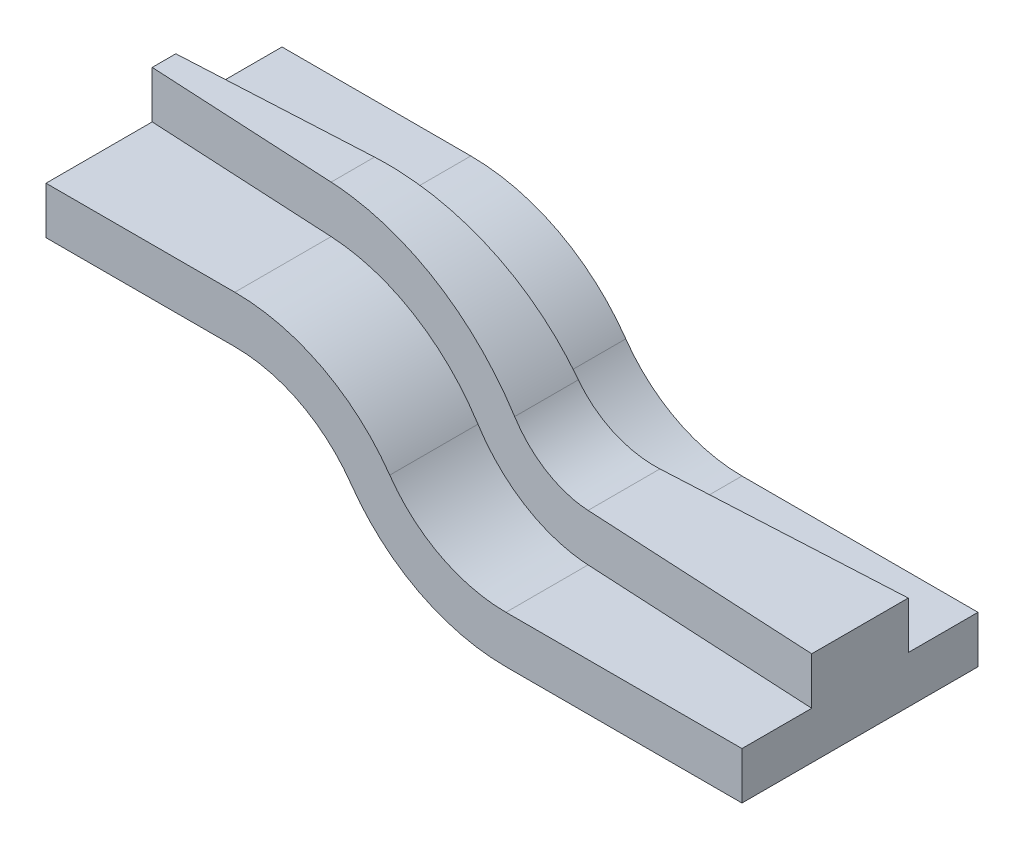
ISO-10303-21;
HEADER;
FILE_DESCRIPTION(('STEP AP214'),'2;1');
FILE_NAME('part.step','',(''),(''),'','','');
FILE_SCHEMA(('AUTOMOTIVE_DESIGN { 1 0 10303 214 1 1 1 1 }'));
ENDSEC;
DATA;
#1=APPLICATION_CONTEXT('core data for automotive mechanical design processes');
#2=APPLICATION_PROTOCOL_DEFINITION('international standard','automotive_design',2000,#1);
#3=PRODUCT_CONTEXT('',#1,'mechanical');
#4=PRODUCT('Part','Part','',(#3));
#5=PRODUCT_RELATED_PRODUCT_CATEGORY('part','',(#4));
#6=PRODUCT_DEFINITION_FORMATION('','',#4);
#7=PRODUCT_DEFINITION_CONTEXT('part definition',#1,'design');
#8=PRODUCT_DEFINITION('design','',#6,#7);
#9=PRODUCT_DEFINITION_SHAPE('','',#8);
#10=(LENGTH_UNIT() NAMED_UNIT(*) SI_UNIT(.MILLI.,.METRE.));
#11=(NAMED_UNIT(*) PLANE_ANGLE_UNIT() SI_UNIT($,.RADIAN.));
#12=(NAMED_UNIT(*) SI_UNIT($,.STERADIAN.) SOLID_ANGLE_UNIT());
#13=UNCERTAINTY_MEASURE_WITH_UNIT(LENGTH_MEASURE(1.E-05),#10,'distance_accuracy_value','');
#14=(GEOMETRIC_REPRESENTATION_CONTEXT(3) GLOBAL_UNCERTAINTY_ASSIGNED_CONTEXT((#13)) GLOBAL_UNIT_ASSIGNED_CONTEXT((#10,
#11,#12)) REPRESENTATION_CONTEXT('',''));
#15=CARTESIAN_POINT('',(0.,0.,0.));
#16=DIRECTION('',(0.,0.,1.));
#17=DIRECTION('',(1.,0.,0.));
#18=AXIS2_PLACEMENT_3D('',#15,#16,#17);
#19=CARTESIAN_POINT('',(97.4456264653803,-30.,25.));
#20=DIRECTION('',(0.,1.,0.));
#21=DIRECTION('',(-1.,0.,0.));
#22=AXIS2_PLACEMENT_3D('',#19,#20,#21);
#23=PLANE('',#22);
#24=DIRECTION('',(0.,0.,-1.));
#25=VECTOR('',#24,1.);
#26=CARTESIAN_POINT('',(97.4456264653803,-30.,25.));
#27=LINE('',#26,#25);
#28=CARTESIAN_POINT('',(97.4456264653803,-30.,-7.60690888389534));
#29=VERTEX_POINT('',#28);
#30=CARTESIAN_POINT('',(97.4456264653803,-30.,-25.));
#31=VERTEX_POINT('',#30);
#32=EDGE_CURVE('E309',#29,#31,#27,.T.);
#33=ORIENTED_EDGE('',*,*,#32,.F.);
#34=DIRECTION('',(0.998629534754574,0.,-0.052335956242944));
#35=VECTOR('',#34,1.);
#36=CARTESIAN_POINT('',(95.7414514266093,-30.,-7.51759685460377));
#37=LINE('',#36,#35);
#38=CARTESIAN_POINT('',(147.44562646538,-30.,-10.2272978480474));
#39=VERTEX_POINT('',#38);
#40=EDGE_CURVE('E226',#29,#39,#37,.T.);
#41=ORIENTED_EDGE('',*,*,#40,.T.);
#42=DIRECTION('',(0.,0.,-1.));
#43=VECTOR('',#42,1.);
#44=CARTESIAN_POINT('',(147.44562646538,-30.,25.));
#45=LINE('',#44,#43);
#46=CARTESIAN_POINT('',(147.44562646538,-30.,-25.));
#47=VERTEX_POINT('',#46);
#48=EDGE_CURVE('E312',#39,#47,#45,.T.);
#49=ORIENTED_EDGE('',*,*,#48,.T.);
#50=DIRECTION('',(1.,0.,0.));
#51=VECTOR('',#50,1.);
#52=CARTESIAN_POINT('',(97.4456264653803,-30.,-25.));
#53=LINE('',#52,#51);
#54=EDGE_CURVE('E243',#31,#47,#53,.T.);
#55=ORIENTED_EDGE('',*,*,#54,.F.);
#56=EDGE_LOOP('',(#33,#41,#49,#55));
#57=FACE_BOUND('',#56,.T.);
#58=ADVANCED_FACE('F33',(#57),#23,.T.);
#59=CARTESIAN_POINT('',(97.4456264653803,0.,25.));
#60=DIRECTION('',(0.,0.,-1.));
#61=DIRECTION('',(-1.,0.,0.));
#62=AXIS2_PLACEMENT_3D('',#59,#60,#61);
#63=CYLINDRICAL_SURFACE('',#62,30.);
#64=DIRECTION('',(0.,0.,-1.));
#65=VECTOR('',#64,1.);
#66=CARTESIAN_POINT('',(72.8260722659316,-17.1428571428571,25.));
#67=LINE('',#66,#65);
#68=CARTESIAN_POINT('',(72.8260722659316,-17.1428571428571,-6.31665272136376));
#69=VERTEX_POINT('',#68);
#70=CARTESIAN_POINT('',(72.8260722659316,-17.1428571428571,-25.));
#71=VERTEX_POINT('',#70);
#72=EDGE_CURVE('E305',#69,#71,#67,.T.);
#73=ORIENTED_EDGE('',*,*,#72,.F.);
#74=CARTESIAN_POINT('',(97.4456264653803,0.,-7.60690888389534));
#75=DIRECTION('',(0.0523359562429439,0.,0.998629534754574));
#76=DIRECTION('',(0.998629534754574,0.,-0.052335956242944));
#77=AXIS2_PLACEMENT_3D('',#74,#75,#76);
#78=ELLIPSE('',#77,30.0411703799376,30.);
#79=EDGE_CURVE('E223',#69,#29,#78,.T.);
#80=ORIENTED_EDGE('',*,*,#79,.T.);
#81=ORIENTED_EDGE('',*,*,#32,.T.);
#82=CARTESIAN_POINT('',(97.4456264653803,0.,-25.));
#83=DIRECTION('',(0.,0.,1.));
#84=DIRECTION('',(1.,0.,0.));
#85=AXIS2_PLACEMENT_3D('',#82,#83,#84);
#86=CIRCLE('',#85,30.);
#87=EDGE_CURVE('E246',#71,#31,#86,.T.);
#88=ORIENTED_EDGE('',*,*,#87,.F.);
#89=EDGE_LOOP('',(#73,#80,#81,#88));
#90=FACE_BOUND('',#89,.T.);
#91=ADVANCED_FACE('F331',(#90),#63,.F.);
#92=CARTESIAN_POINT('',(40.,-40.,25.));
#93=DIRECTION('',(0.,0.,-1.));
#94=DIRECTION('',(-1.,0.,0.));
#95=AXIS2_PLACEMENT_3D('',#92,#93,#94);
#96=CYLINDRICAL_SURFACE('',#95,40.);
#97=DIRECTION('',(0.,0.,-1.));
#98=VECTOR('',#97,1.);
#99=CARTESIAN_POINT('',(40.,0.,25.));
#100=LINE('',#99,#98);
#101=CARTESIAN_POINT('',(40.,0.,-4.59631117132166));
#102=VERTEX_POINT('',#101);
#103=CARTESIAN_POINT('',(40.,0.,-25.));
#104=VERTEX_POINT('',#103);
#105=EDGE_CURVE('E301',#102,#104,#100,.T.);
#106=ORIENTED_EDGE('',*,*,#105,.F.);
#107=CARTESIAN_POINT('',(40.,-40.,-4.59631117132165));
#108=DIRECTION('',(0.0523359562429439,0.,0.998629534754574));
#109=DIRECTION('',(0.998629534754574,0.,-0.052335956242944));
#110=AXIS2_PLACEMENT_3D('',#107,#108,#109);
#111=ELLIPSE('',#110,40.0548938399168,40.);
#112=EDGE_CURVE('E220',#102,#69,#111,.F.);
#113=ORIENTED_EDGE('',*,*,#112,.T.);
#114=ORIENTED_EDGE('',*,*,#72,.T.);
#115=CARTESIAN_POINT('',(40.,-40.,-25.));
#116=DIRECTION('',(0.,0.,-1.));
#117=DIRECTION('',(-1.,0.,0.));
#118=AXIS2_PLACEMENT_3D('',#115,#116,#117);
#119=CIRCLE('',#118,40.);
#120=EDGE_CURVE('E249',#104,#71,#119,.T.);
#121=ORIENTED_EDGE('',*,*,#120,.F.);
#122=EDGE_LOOP('',(#106,#113,#114,#121));
#123=FACE_BOUND('',#122,.T.);
#124=ADVANCED_FACE('F336',(#123),#96,.T.);
#125=CARTESIAN_POINT('',(0.,0.,25.));
#126=DIRECTION('',(0.,1.,0.));
#127=DIRECTION('',(0.,0.,1.));
#128=AXIS2_PLACEMENT_3D('',#125,#126,#127);
#129=PLANE('',#128);
#130=DIRECTION('',(0.,0.,-1.));
#131=VECTOR('',#130,1.);
#132=CARTESIAN_POINT('',(0.,0.,25.));
#133=LINE('',#132,#131);
#134=CARTESIAN_POINT('',(0.,0.,-2.5));
#135=VERTEX_POINT('',#134);
#136=CARTESIAN_POINT('',(0.,0.,-25.));
#137=VERTEX_POINT('',#136);
#138=EDGE_CURVE('E299',#135,#137,#133,.T.);
#139=ORIENTED_EDGE('',*,*,#138,.F.);
#140=DIRECTION('',(0.998629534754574,0.,-0.052335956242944));
#141=VECTOR('',#140,1.);
#142=CARTESIAN_POINT('',(-1.43726636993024,0.,-2.42467606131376));
#143=LINE('',#142,#141);
#144=EDGE_CURVE('E217',#135,#102,#143,.T.);
#145=ORIENTED_EDGE('',*,*,#144,.T.);
#146=ORIENTED_EDGE('',*,*,#105,.T.);
#147=DIRECTION('',(1.,0.,0.));
#148=VECTOR('',#147,1.);
#149=CARTESIAN_POINT('',(0.,0.,-25.));
#150=LINE('',#149,#148);
#151=EDGE_CURVE('E252',#137,#104,#150,.T.);
#152=ORIENTED_EDGE('',*,*,#151,.F.);
#153=EDGE_LOOP('',(#139,#145,#146,#152));
#154=FACE_BOUND('',#153,.T.);
#155=ADVANCED_FACE('F340',(#154),#129,.T.);
#156=CARTESIAN_POINT('',(97.4456264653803,-40.,25.));
#157=DIRECTION('',(0.,1.,0.));
#158=DIRECTION('',(-1.,0.,0.));
#159=AXIS2_PLACEMENT_3D('',#156,#157,#158);
#160=PLANE('',#159);
#161=DIRECTION('',(0.,0.,-1.));
#162=VECTOR('',#161,1.);
#163=CARTESIAN_POINT('',(97.4456264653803,-40.,25.));
#164=LINE('',#163,#162);
#165=CARTESIAN_POINT('',(97.4456264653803,-40.,25.));
#166=VERTEX_POINT('',#165);
#167=CARTESIAN_POINT('',(97.4456264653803,-40.,-25.));
#168=VERTEX_POINT('',#167);
#169=EDGE_CURVE('E291',#166,#168,#164,.T.);
#170=ORIENTED_EDGE('',*,*,#169,.T.);
#171=DIRECTION('',(1.,0.,0.));
#172=VECTOR('',#171,1.);
#173=CARTESIAN_POINT('',(97.4456264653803,-40.,-25.));
#174=LINE('',#173,#172);
#175=CARTESIAN_POINT('',(147.44562646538,-40.,-25.));
#176=VERTEX_POINT('',#175);
#177=EDGE_CURVE('E237',#168,#176,#174,.T.);
#178=ORIENTED_EDGE('',*,*,#177,.T.);
#179=DIRECTION('',(0.,0.,-1.));
#180=VECTOR('',#179,1.);
#181=CARTESIAN_POINT('',(147.44562646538,-40.,25.));
#182=LINE('',#181,#180);
#183=CARTESIAN_POINT('',(147.44562646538,-40.,25.));
#184=VERTEX_POINT('',#183);
#185=EDGE_CURVE('E11',#184,#176,#182,.T.);
#186=ORIENTED_EDGE('',*,*,#185,.F.);
#187=DIRECTION('',(1.,0.,0.));
#188=VECTOR('',#187,1.);
#189=CARTESIAN_POINT('',(97.4456264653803,-40.,25.));
#190=LINE('',#189,#188);
#191=EDGE_CURVE('E267',#166,#184,#190,.T.);
#192=ORIENTED_EDGE('',*,*,#191,.F.);
#193=EDGE_LOOP('',(#170,#178,#186,#192));
#194=FACE_BOUND('',#193,.T.);
#195=ADVANCED_FACE('F35',(#194),#160,.F.);
#196=CARTESIAN_POINT('',(147.44562646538,-30.,25.));
#197=DIRECTION('',(1.,0.,0.));
#198=DIRECTION('',(0.,0.,-1.));
#199=AXIS2_PLACEMENT_3D('',#196,#197,#198);
#200=PLANE('',#199);
#201=ORIENTED_EDGE('',*,*,#185,.T.);
#202=DIRECTION('',(0.,-1.,0.));
#203=VECTOR('',#202,1.);
#204=CARTESIAN_POINT('',(147.44562646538,-30.,-25.));
#205=LINE('',#204,#203);
#206=EDGE_CURVE('E240',#47,#176,#205,.T.);
#207=ORIENTED_EDGE('',*,*,#206,.F.);
#208=ORIENTED_EDGE('',*,*,#48,.F.);
#209=DIRECTION('',(0.,-1.,0.));
#210=VECTOR('',#209,1.);
#211=CARTESIAN_POINT('',(147.44562646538,-20.,-10.2272978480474));
#212=LINE('',#211,#210);
#213=CARTESIAN_POINT('',(147.44562646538,-20.,-10.2272978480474));
#214=VERTEX_POINT('',#213);
#215=EDGE_CURVE('E192',#39,#214,#212,.F.);
#216=ORIENTED_EDGE('',*,*,#215,.T.);
#217=DIRECTION('',(0.,0.,1.));
#218=VECTOR('',#217,1.);
#219=CARTESIAN_POINT('',(147.44562646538,-20.,0.));
#220=LINE('',#219,#218);
#221=CARTESIAN_POINT('',(147.44562646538,-20.,10.2272978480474));
#222=VERTEX_POINT('',#221);
#223=EDGE_CURVE('E197',#214,#222,#220,.T.);
#224=ORIENTED_EDGE('',*,*,#223,.T.);
#225=DIRECTION('',(0.,1.,0.));
#226=VECTOR('',#225,1.);
#227=CARTESIAN_POINT('',(147.44562646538,-15.,10.2272978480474));
#228=LINE('',#227,#226);
#229=CARTESIAN_POINT('',(147.44562646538,-30.,10.2272978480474));
#230=VERTEX_POINT('',#229);
#231=EDGE_CURVE('E177',#230,#222,#228,.T.);
#232=ORIENTED_EDGE('',*,*,#231,.F.);
#233=CARTESIAN_POINT('',(147.44562646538,-30.,25.));
#234=VERTEX_POINT('',#233);
#235=EDGE_CURVE('E41',#234,#230,#45,.T.);
#236=ORIENTED_EDGE('',*,*,#235,.F.);
#237=DIRECTION('',(0.,-1.,0.));
#238=VECTOR('',#237,1.);
#239=CARTESIAN_POINT('',(147.44562646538,-30.,25.));
#240=LINE('',#239,#238);
#241=EDGE_CURVE('E269',#234,#184,#240,.T.);
#242=ORIENTED_EDGE('',*,*,#241,.T.);
#243=EDGE_LOOP('',(#201,#207,#208,#216,#224,#232,#236,#242));
#244=FACE_BOUND('',#243,.T.);
#245=ADVANCED_FACE('F322',(#244),#200,.T.);
#246=DIRECTION('',(0.998629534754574,0.,0.052335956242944));
#247=VECTOR('',#246,1.);
#248=CARTESIAN_POINT('',(98.3546630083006,-30.,7.65454947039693));
#249=LINE('',#248,#247);
#250=CARTESIAN_POINT('',(97.4456264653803,-30.,7.60690888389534));
#251=VERTEX_POINT('',#250);
#252=EDGE_CURVE('E235',#251,#230,#249,.T.);
#253=ORIENTED_EDGE('',*,*,#252,.F.);
#254=CARTESIAN_POINT('',(97.4456264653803,-30.,25.));
#255=VERTEX_POINT('',#254);
#256=EDGE_CURVE('E310',#255,#251,#27,.T.);
#257=ORIENTED_EDGE('',*,*,#256,.F.);
#258=DIRECTION('',(1.,0.,0.));
#259=VECTOR('',#258,1.);
#260=CARTESIAN_POINT('',(97.4456264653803,-30.,25.));
#261=LINE('',#260,#259);
#262=EDGE_CURVE('E272',#255,#234,#261,.T.);
#263=ORIENTED_EDGE('',*,*,#262,.T.);
#264=ORIENTED_EDGE('',*,*,#235,.T.);
#265=EDGE_LOOP('',(#253,#257,#263,#264));
#266=FACE_BOUND('',#265,.T.);
#267=ADVANCED_FACE('F369',(#266),#23,.T.);
#268=CARTESIAN_POINT('',(97.4456264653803,0.,7.60690888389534));
#269=DIRECTION('',(-0.0523359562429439,0.,0.998629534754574));
#270=DIRECTION('',(-0.998629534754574,0.,-0.052335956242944));
#271=AXIS2_PLACEMENT_3D('',#268,#269,#270);
#272=ELLIPSE('',#271,30.0411703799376,30.);
#273=CARTESIAN_POINT('',(72.8260722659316,-17.1428571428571,6.31665272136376));
#274=VERTEX_POINT('',#273);
#275=EDGE_CURVE('E233',#274,#251,#272,.T.);
#276=ORIENTED_EDGE('',*,*,#275,.F.);
#277=CARTESIAN_POINT('',(72.8260722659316,-17.1428571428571,25.));
#278=VERTEX_POINT('',#277);
#279=EDGE_CURVE('E306',#278,#274,#67,.T.);
#280=ORIENTED_EDGE('',*,*,#279,.F.);
#281=CARTESIAN_POINT('',(97.4456264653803,0.,25.));
#282=DIRECTION('',(0.,0.,1.));
#283=DIRECTION('',(1.,0.,0.));
#284=AXIS2_PLACEMENT_3D('',#281,#282,#283);
#285=CIRCLE('',#284,30.);
#286=EDGE_CURVE('E275',#278,#255,#285,.T.);
#287=ORIENTED_EDGE('',*,*,#286,.T.);
#288=ORIENTED_EDGE('',*,*,#256,.T.);
#289=EDGE_LOOP('',(#276,#280,#287,#288));
#290=FACE_BOUND('',#289,.T.);
#291=ADVANCED_FACE('F374',(#290),#63,.F.);
#292=CARTESIAN_POINT('',(40.,-40.,4.59631117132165));
#293=DIRECTION('',(-0.0523359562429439,0.,0.998629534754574));
#294=DIRECTION('',(-0.998629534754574,0.,-0.052335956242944));
#295=AXIS2_PLACEMENT_3D('',#292,#293,#294);
#296=ELLIPSE('',#295,40.0548938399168,40.);
#297=CARTESIAN_POINT('',(40.,0.,4.59631117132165));
#298=VERTEX_POINT('',#297);
#299=EDGE_CURVE('E231',#298,#274,#296,.F.);
#300=ORIENTED_EDGE('',*,*,#299,.F.);
#301=CARTESIAN_POINT('',(40.,0.,25.));
#302=VERTEX_POINT('',#301);
#303=EDGE_CURVE('E302',#302,#298,#100,.T.);
#304=ORIENTED_EDGE('',*,*,#303,.F.);
#305=CARTESIAN_POINT('',(40.,-40.,25.));
#306=DIRECTION('',(0.,0.,-1.));
#307=DIRECTION('',(-1.,0.,0.));
#308=AXIS2_PLACEMENT_3D('',#305,#306,#307);
#309=CIRCLE('',#308,40.);
#310=EDGE_CURVE('E278',#302,#278,#309,.T.);
#311=ORIENTED_EDGE('',*,*,#310,.T.);
#312=ORIENTED_EDGE('',*,*,#279,.T.);
#313=EDGE_LOOP('',(#300,#304,#311,#312));
#314=FACE_BOUND('',#313,.T.);
#315=ADVANCED_FACE('F380',(#314),#96,.T.);
#316=DIRECTION('',(0.998629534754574,0.,0.052335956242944));
#317=VECTOR('',#316,1.);
#318=CARTESIAN_POINT('',(1.1759452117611,0.,2.56162867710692));
#319=LINE('',#318,#317);
#320=CARTESIAN_POINT('',(0.,0.,2.5));
#321=VERTEX_POINT('',#320);
#322=EDGE_CURVE('E229',#321,#298,#319,.T.);
#323=ORIENTED_EDGE('',*,*,#322,.F.);
#324=CARTESIAN_POINT('',(0.,0.,25.));
#325=VERTEX_POINT('',#324);
#326=EDGE_CURVE('E191',#325,#321,#133,.T.);
#327=ORIENTED_EDGE('',*,*,#326,.F.);
#328=DIRECTION('',(1.,0.,0.));
#329=VECTOR('',#328,1.);
#330=CARTESIAN_POINT('',(0.,0.,25.));
#331=LINE('',#330,#329);
#332=EDGE_CURVE('E281',#325,#302,#331,.T.);
#333=ORIENTED_EDGE('',*,*,#332,.T.);
#334=ORIENTED_EDGE('',*,*,#303,.T.);
#335=EDGE_LOOP('',(#323,#327,#333,#334));
#336=FACE_BOUND('',#335,.T.);
#337=ADVANCED_FACE('F392',(#336),#129,.T.);
#338=CARTESIAN_POINT('',(0.,-10.,25.));
#339=DIRECTION('',(-1.,0.,0.));
#340=DIRECTION('',(0.,0.,1.));
#341=AXIS2_PLACEMENT_3D('',#338,#339,#340);
#342=PLANE('',#341);
#343=ORIENTED_EDGE('',*,*,#326,.T.);
#344=DIRECTION('',(0.,-1.,0.));
#345=VECTOR('',#344,1.);
#346=CARTESIAN_POINT('',(0.,-15.,2.5));
#347=LINE('',#346,#345);
#348=CARTESIAN_POINT('',(0.,10.,2.5));
#349=VERTEX_POINT('',#348);
#350=EDGE_CURVE('E182',#349,#321,#347,.T.);
#351=ORIENTED_EDGE('',*,*,#350,.F.);
#352=DIRECTION('',(0.,0.,1.));
#353=VECTOR('',#352,1.);
#354=CARTESIAN_POINT('',(0.,10.,0.));
#355=LINE('',#354,#353);
#356=CARTESIAN_POINT('',(0.,10.,-2.5));
#357=VERTEX_POINT('',#356);
#358=EDGE_CURVE('E169',#357,#349,#355,.T.);
#359=ORIENTED_EDGE('',*,*,#358,.F.);
#360=DIRECTION('',(0.,1.,0.));
#361=VECTOR('',#360,1.);
#362=CARTESIAN_POINT('',(0.,10.,-2.5));
#363=LINE('',#362,#361);
#364=EDGE_CURVE('E48',#357,#135,#363,.F.);
#365=ORIENTED_EDGE('',*,*,#364,.T.);
#366=ORIENTED_EDGE('',*,*,#138,.T.);
#367=DIRECTION('',(0.,1.,0.));
#368=VECTOR('',#367,1.);
#369=CARTESIAN_POINT('',(0.,-10.,-25.));
#370=LINE('',#369,#368);
#371=CARTESIAN_POINT('',(0.,-10.,-25.));
#372=VERTEX_POINT('',#371);
#373=EDGE_CURVE('E255',#372,#137,#370,.T.);
#374=ORIENTED_EDGE('',*,*,#373,.F.);
#375=DIRECTION('',(0.,0.,-1.));
#376=VECTOR('',#375,1.);
#377=CARTESIAN_POINT('',(0.,-10.,25.));
#378=LINE('',#377,#376);
#379=CARTESIAN_POINT('',(0.,-10.,25.));
#380=VERTEX_POINT('',#379);
#381=EDGE_CURVE('E297',#380,#372,#378,.T.);
#382=ORIENTED_EDGE('',*,*,#381,.F.);
#383=DIRECTION('',(0.,1.,0.));
#384=VECTOR('',#383,1.);
#385=CARTESIAN_POINT('',(0.,-10.,25.));
#386=LINE('',#385,#384);
#387=EDGE_CURVE('E284',#380,#325,#386,.T.);
#388=ORIENTED_EDGE('',*,*,#387,.T.);
#389=EDGE_LOOP('',(#343,#351,#359,#365,#366,#374,#382,#388));
#390=FACE_BOUND('',#389,.T.);
#391=ADVANCED_FACE('F189',(#390),#342,.T.);
#392=CARTESIAN_POINT('',(0.,-10.,25.));
#393=DIRECTION('',(0.,1.,0.));
#394=DIRECTION('',(0.,0.,1.));
#395=AXIS2_PLACEMENT_3D('',#392,#393,#394);
#396=PLANE('',#395);
#397=ORIENTED_EDGE('',*,*,#381,.T.);
#398=DIRECTION('',(1.,0.,0.));
#399=VECTOR('',#398,1.);
#400=CARTESIAN_POINT('',(0.,-10.,-25.));
#401=LINE('',#400,#399);
#402=CARTESIAN_POINT('',(40.,-9.99999999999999,-25.));
#403=VERTEX_POINT('',#402);
#404=EDGE_CURVE('E258',#372,#403,#401,.T.);
#405=ORIENTED_EDGE('',*,*,#404,.T.);
#406=DIRECTION('',(0.,0.,-1.));
#407=VECTOR('',#406,1.);
#408=CARTESIAN_POINT('',(40.,-9.99999999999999,25.));
#409=LINE('',#408,#407);
#410=CARTESIAN_POINT('',(40.,-9.99999999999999,25.));
#411=VERTEX_POINT('',#410);
#412=EDGE_CURVE('E295',#411,#403,#409,.T.);
#413=ORIENTED_EDGE('',*,*,#412,.F.);
#414=DIRECTION('',(1.,0.,0.));
#415=VECTOR('',#414,1.);
#416=CARTESIAN_POINT('',(0.,-10.,25.));
#417=LINE('',#416,#415);
#418=EDGE_CURVE('E286',#380,#411,#417,.T.);
#419=ORIENTED_EDGE('',*,*,#418,.F.);
#420=EDGE_LOOP('',(#397,#405,#413,#419));
#421=FACE_BOUND('',#420,.T.);
#422=ADVANCED_FACE('F399',(#421),#396,.F.);
#423=CARTESIAN_POINT('',(40.,-40.,25.));
#424=DIRECTION('',(0.,0.,-1.));
#425=DIRECTION('',(-1.,0.,0.));
#426=AXIS2_PLACEMENT_3D('',#423,#424,#425);
#427=CYLINDRICAL_SURFACE('',#426,30.);
#428=ORIENTED_EDGE('',*,*,#412,.T.);
#429=CARTESIAN_POINT('',(40.,-40.,-25.));
#430=DIRECTION('',(0.,0.,1.));
#431=DIRECTION('',(1.,0.,0.));
#432=AXIS2_PLACEMENT_3D('',#429,#430,#431);
#433=CIRCLE('',#432,30.);
#434=CARTESIAN_POINT('',(64.6195541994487,-22.8571428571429,-25.));
#435=VERTEX_POINT('',#434);
#436=EDGE_CURVE('E261',#403,#435,#433,.F.);
#437=ORIENTED_EDGE('',*,*,#436,.T.);
#438=DIRECTION('',(0.,0.,-1.));
#439=VECTOR('',#438,1.);
#440=CARTESIAN_POINT('',(64.6195541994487,-22.8571428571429,25.));
#441=LINE('',#440,#439);
#442=CARTESIAN_POINT('',(64.6195541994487,-22.8571428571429,25.));
#443=VERTEX_POINT('',#442);
#444=EDGE_CURVE('E293',#443,#435,#441,.T.);
#445=ORIENTED_EDGE('',*,*,#444,.F.);
#446=CARTESIAN_POINT('',(40.,-40.,25.));
#447=DIRECTION('',(0.,0.,1.));
#448=DIRECTION('',(1.,0.,0.));
#449=AXIS2_PLACEMENT_3D('',#446,#447,#448);
#450=CIRCLE('',#449,30.);
#451=EDGE_CURVE('E288',#411,#443,#450,.F.);
#452=ORIENTED_EDGE('',*,*,#451,.F.);
#453=EDGE_LOOP('',(#428,#437,#445,#452));
#454=FACE_BOUND('',#453,.T.);
#455=ADVANCED_FACE('F403',(#454),#427,.F.);
#456=CARTESIAN_POINT('',(97.4456264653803,0.,25.));
#457=DIRECTION('',(0.,0.,-1.));
#458=DIRECTION('',(-1.,0.,0.));
#459=AXIS2_PLACEMENT_3D('',#456,#457,#458);
#460=CYLINDRICAL_SURFACE('',#459,40.);
#461=ORIENTED_EDGE('',*,*,#444,.T.);
#462=CARTESIAN_POINT('',(97.4456264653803,0.,-25.));
#463=DIRECTION('',(0.,0.,1.));
#464=DIRECTION('',(1.,0.,0.));
#465=AXIS2_PLACEMENT_3D('',#462,#463,#464);
#466=CIRCLE('',#465,40.);
#467=EDGE_CURVE('E264',#435,#168,#466,.T.);
#468=ORIENTED_EDGE('',*,*,#467,.T.);
#469=ORIENTED_EDGE('',*,*,#169,.F.);
#470=CARTESIAN_POINT('',(97.4456264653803,0.,25.));
#471=DIRECTION('',(0.,0.,1.));
#472=DIRECTION('',(1.,0.,0.));
#473=AXIS2_PLACEMENT_3D('',#470,#471,#472);
#474=CIRCLE('',#473,40.);
#475=EDGE_CURVE('E56',#443,#166,#474,.T.);
#476=ORIENTED_EDGE('',*,*,#475,.F.);
#477=EDGE_LOOP('',(#461,#468,#469,#476));
#478=FACE_BOUND('',#477,.T.);
#479=ADVANCED_FACE('F407',(#478),#460,.T.);
#480=CARTESIAN_POINT('',(97.4456264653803,0.,25.));
#481=DIRECTION('',(0.,0.,1.));
#482=DIRECTION('',(1.,0.,0.));
#483=AXIS2_PLACEMENT_3D('',#480,#481,#482);
#484=PLANE('',#483);
#485=ORIENTED_EDGE('',*,*,#191,.T.);
#486=ORIENTED_EDGE('',*,*,#241,.F.);
#487=ORIENTED_EDGE('',*,*,#262,.F.);
#488=ORIENTED_EDGE('',*,*,#286,.F.);
#489=ORIENTED_EDGE('',*,*,#310,.F.);
#490=ORIENTED_EDGE('',*,*,#332,.F.);
#491=ORIENTED_EDGE('',*,*,#387,.F.);
#492=ORIENTED_EDGE('',*,*,#418,.T.);
#493=ORIENTED_EDGE('',*,*,#451,.T.);
#494=ORIENTED_EDGE('',*,*,#475,.T.);
#495=EDGE_LOOP('',(#485,#486,#487,#488,#489,#490,#491,#492,#493,#494));
#496=FACE_BOUND('',#495,.T.);
#497=ADVANCED_FACE('F386',(#496),#484,.T.);
#498=CARTESIAN_POINT('',(97.4456264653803,0.,-25.));
#499=DIRECTION('',(0.,0.,1.));
#500=DIRECTION('',(1.,0.,0.));
#501=AXIS2_PLACEMENT_3D('',#498,#499,#500);
#502=PLANE('',#501);
#503=ORIENTED_EDGE('',*,*,#177,.F.);
#504=ORIENTED_EDGE('',*,*,#467,.F.);
#505=ORIENTED_EDGE('',*,*,#436,.F.);
#506=ORIENTED_EDGE('',*,*,#404,.F.);
#507=ORIENTED_EDGE('',*,*,#373,.T.);
#508=ORIENTED_EDGE('',*,*,#151,.T.);
#509=ORIENTED_EDGE('',*,*,#120,.T.);
#510=ORIENTED_EDGE('',*,*,#87,.T.);
#511=ORIENTED_EDGE('',*,*,#54,.T.);
#512=ORIENTED_EDGE('',*,*,#206,.T.);
#513=EDGE_LOOP('',(#503,#504,#505,#506,#507,#508,#509,#510,#511,#512));
#514=FACE_BOUND('',#513,.T.);
#515=ADVANCED_FACE('F326',(#514),#502,.F.);
#516=CARTESIAN_POINT('',(97.4456264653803,-20.,0.));
#517=DIRECTION('',(0.,1.,0.));
#518=DIRECTION('',(-1.,0.,0.));
#519=AXIS2_PLACEMENT_3D('',#516,#517,#518);
#520=PLANE('',#519);
#521=ORIENTED_EDGE('',*,*,#223,.F.);
#522=DIRECTION('',(0.998629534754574,0.,-0.052335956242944));
#523=VECTOR('',#522,1.);
#524=CARTESIAN_POINT('',(97.048057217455,-20.,-7.58607316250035));
#525=LINE('',#524,#523);
#526=CARTESIAN_POINT('',(97.4456264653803,-20.,-7.60690888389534));
#527=VERTEX_POINT('',#526);
#528=EDGE_CURVE('E194',#214,#527,#525,.F.);
#529=ORIENTED_EDGE('',*,*,#528,.T.);
#530=DIRECTION('',(0.,0.,1.));
#531=VECTOR('',#530,1.);
#532=CARTESIAN_POINT('',(97.4456264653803,-20.,0.));
#533=LINE('',#532,#531);
#534=CARTESIAN_POINT('',(97.4456264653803,-20.,7.60690888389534));
#535=VERTEX_POINT('',#534);
#536=EDGE_CURVE('E348',#527,#535,#533,.T.);
#537=ORIENTED_EDGE('',*,*,#536,.T.);
#538=DIRECTION('',(-0.998629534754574,0.,-0.052335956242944));
#539=VECTOR('',#538,1.);
#540=CARTESIAN_POINT('',(0.,-20.,2.5));
#541=LINE('',#540,#539);
#542=EDGE_CURVE('E203',#222,#535,#541,.T.);
#543=ORIENTED_EDGE('',*,*,#542,.F.);
#544=EDGE_LOOP('',(#521,#529,#537,#543));
#545=FACE_BOUND('',#544,.T.);
#546=ADVANCED_FACE('F357',(#545),#520,.T.);
#547=CARTESIAN_POINT('',(97.4456264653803,0.,0.));
#548=DIRECTION('',(0.,0.,-1.));
#549=DIRECTION('',(-1.,0.,0.));
#550=AXIS2_PLACEMENT_3D('',#547,#548,#549);
#551=CYLINDRICAL_SURFACE('',#550,20.);
#552=ORIENTED_EDGE('',*,*,#536,.F.);
#553=CARTESIAN_POINT('',(97.4456264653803,0.,-7.60690888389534));
#554=DIRECTION('',(0.0523359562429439,0.,0.998629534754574));
#555=DIRECTION('',(0.998629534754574,0.,-0.052335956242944));
#556=AXIS2_PLACEMENT_3D('',#553,#554,#555);
#557=ELLIPSE('',#556,20.0274469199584,20.);
#558=CARTESIAN_POINT('',(81.0325903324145,-11.4285714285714,-6.74673810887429));
#559=VERTEX_POINT('',#558);
#560=EDGE_CURVE('E209',#527,#559,#557,.F.);
#561=ORIENTED_EDGE('',*,*,#560,.T.);
#562=DIRECTION('',(0.,0.,1.));
#563=VECTOR('',#562,1.);
#564=CARTESIAN_POINT('',(81.0325903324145,-11.4285714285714,0.));
#565=LINE('',#564,#563);
#566=CARTESIAN_POINT('',(81.0325903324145,-11.4285714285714,6.74673810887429));
#567=VERTEX_POINT('',#566);
#568=EDGE_CURVE('E345',#559,#567,#565,.T.);
#569=ORIENTED_EDGE('',*,*,#568,.T.);
#570=CARTESIAN_POINT('',(97.4456264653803,0.,7.60690888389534));
#571=DIRECTION('',(-0.0523359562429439,0.,0.998629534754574));
#572=DIRECTION('',(-0.998629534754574,0.,-0.052335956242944));
#573=AXIS2_PLACEMENT_3D('',#570,#571,#572);
#574=ELLIPSE('',#573,20.0274469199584,20.);
#575=EDGE_CURVE('E201',#535,#567,#574,.F.);
#576=ORIENTED_EDGE('',*,*,#575,.F.);
#577=EDGE_LOOP('',(#552,#561,#569,#576));
#578=FACE_BOUND('',#577,.T.);
#579=ADVANCED_FACE('F358',(#578),#551,.F.);
#580=CARTESIAN_POINT('',(40.,-40.,0.));
#581=DIRECTION('',(0.,0.,1.));
#582=DIRECTION('',(1.,0.,0.));
#583=AXIS2_PLACEMENT_3D('',#580,#581,#582);
#584=CYLINDRICAL_SURFACE('',#583,50.);
#585=ORIENTED_EDGE('',*,*,#568,.F.);
#586=CARTESIAN_POINT('',(40.,-40.,-4.59631117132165));
#587=DIRECTION('',(0.0523359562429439,0.,0.998629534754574));
#588=DIRECTION('',(-0.998629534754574,0.,0.052335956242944));
#589=AXIS2_PLACEMENT_3D('',#586,#587,#588);
#590=ELLIPSE('',#589,50.0686172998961,50.);
#591=CARTESIAN_POINT('',(40.,10.,-4.59631117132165));
#592=VERTEX_POINT('',#591);
#593=EDGE_CURVE('E212',#559,#592,#590,.T.);
#594=ORIENTED_EDGE('',*,*,#593,.T.);
#595=DIRECTION('',(0.,0.,1.));
#596=VECTOR('',#595,1.);
#597=CARTESIAN_POINT('',(40.,10.,0.));
#598=LINE('',#597,#596);
#599=CARTESIAN_POINT('',(40.,10.,4.59631117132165));
#600=VERTEX_POINT('',#599);
#601=EDGE_CURVE('E176',#592,#600,#598,.T.);
#602=ORIENTED_EDGE('',*,*,#601,.T.);
#603=CARTESIAN_POINT('',(40.,-40.,4.59631117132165));
#604=DIRECTION('',(-0.0523359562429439,0.,0.998629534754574));
#605=DIRECTION('',(0.998629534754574,0.,0.052335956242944));
#606=AXIS2_PLACEMENT_3D('',#603,#604,#605);
#607=ELLIPSE('',#606,50.0686172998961,50.);
#608=EDGE_CURVE('E186',#567,#600,#607,.T.);
#609=ORIENTED_EDGE('',*,*,#608,.F.);
#610=EDGE_LOOP('',(#585,#594,#602,#609));
#611=FACE_BOUND('',#610,.T.);
#612=ADVANCED_FACE('F344',(#611),#584,.T.);
#613=CARTESIAN_POINT('',(0.,10.,0.));
#614=DIRECTION('',(0.,1.,0.));
#615=DIRECTION('',(-1.,0.,0.));
#616=AXIS2_PLACEMENT_3D('',#613,#614,#615);
#617=PLANE('',#616);
#618=ORIENTED_EDGE('',*,*,#601,.F.);
#619=DIRECTION('',(0.998629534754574,0.,-0.052335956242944));
#620=VECTOR('',#619,1.);
#621=CARTESIAN_POINT('',(-0.130660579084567,10.,-2.49315236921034));
#622=LINE('',#621,#620);
#623=EDGE_CURVE('E174',#592,#357,#622,.F.);
#624=ORIENTED_EDGE('',*,*,#623,.T.);
#625=ORIENTED_EDGE('',*,*,#358,.T.);
#626=DIRECTION('',(-0.998629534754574,0.,-0.052335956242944));
#627=VECTOR('',#626,1.);
#628=CARTESIAN_POINT('',(0.,10.,2.5));
#629=LINE('',#628,#627);
#630=EDGE_CURVE('E172',#600,#349,#629,.T.);
#631=ORIENTED_EDGE('',*,*,#630,.F.);
#632=EDGE_LOOP('',(#618,#624,#625,#631));
#633=FACE_BOUND('',#632,.T.);
#634=ADVANCED_FACE('F171',(#633),#617,.T.);
#635=CARTESIAN_POINT('',(0.,-15.,2.5));
#636=DIRECTION('',(-0.0523359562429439,0.,0.998629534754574));
#637=DIRECTION('',(0.998629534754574,0.,0.052335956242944));
#638=AXIS2_PLACEMENT_3D('',#635,#636,#637);
#639=PLANE('',#638);
#640=ORIENTED_EDGE('',*,*,#275,.T.);
#641=ORIENTED_EDGE('',*,*,#252,.T.);
#642=ORIENTED_EDGE('',*,*,#231,.T.);
#643=ORIENTED_EDGE('',*,*,#542,.T.);
#644=ORIENTED_EDGE('',*,*,#575,.T.);
#645=ORIENTED_EDGE('',*,*,#608,.T.);
#646=ORIENTED_EDGE('',*,*,#630,.T.);
#647=ORIENTED_EDGE('',*,*,#350,.T.);
#648=ORIENTED_EDGE('',*,*,#322,.T.);
#649=ORIENTED_EDGE('',*,*,#299,.T.);
#650=EDGE_LOOP('',(#640,#641,#642,#643,#644,#645,#646,#647,#648,#649));
#651=FACE_BOUND('',#650,.T.);
#652=ADVANCED_FACE('F181',(#651),#639,.T.);
#653=CARTESIAN_POINT('',(0.,-15.,-2.5));
#654=DIRECTION('',(0.0523359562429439,0.,0.998629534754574));
#655=DIRECTION('',(0.998629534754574,0.,-0.052335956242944));
#656=AXIS2_PLACEMENT_3D('',#653,#654,#655);
#657=PLANE('',#656);
#658=ORIENTED_EDGE('',*,*,#40,.F.);
#659=ORIENTED_EDGE('',*,*,#79,.F.);
#660=ORIENTED_EDGE('',*,*,#112,.F.);
#661=ORIENTED_EDGE('',*,*,#144,.F.);
#662=ORIENTED_EDGE('',*,*,#364,.F.);
#663=ORIENTED_EDGE('',*,*,#623,.F.);
#664=ORIENTED_EDGE('',*,*,#593,.F.);
#665=ORIENTED_EDGE('',*,*,#560,.F.);
#666=ORIENTED_EDGE('',*,*,#528,.F.);
#667=ORIENTED_EDGE('',*,*,#215,.F.);
#668=EDGE_LOOP('',(#658,#659,#660,#661,#662,#663,#664,#665,#666,#667));
#669=FACE_BOUND('',#668,.T.);
#670=ADVANCED_FACE('F333',(#669),#657,.F.);
#671=CLOSED_SHELL('',(#58,#91,#124,#155,#195,#245,#267,#291,#315,#337,#391,#422,#455,#479,#497,
#515,#546,#579,#612,#634,#652,#670));
#672=MANIFOLD_SOLID_BREP('B2',#671);
#673=ADVANCED_BREP_SHAPE_REPRESENTATION('',(#18,#672),#14);
#674=SHAPE_DEFINITION_REPRESENTATION(#9,#673);
ENDSEC;
END-ISO-10303-21;
